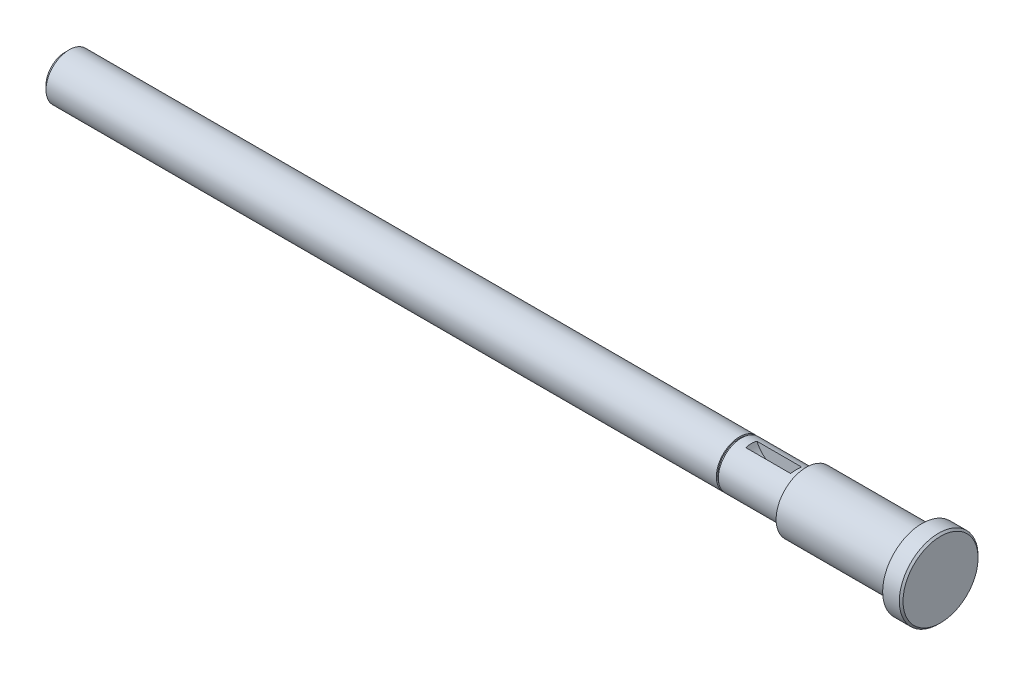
ISO-10303-21;
HEADER;
FILE_DESCRIPTION(('STEP AP214'),'2;1');
FILE_NAME('part.step','',(''),(''),'','','');
FILE_SCHEMA(('AUTOMOTIVE_DESIGN { 1 0 10303 214 1 1 1 1 }'));
ENDSEC;
DATA;
#1=APPLICATION_CONTEXT('core data for automotive mechanical design processes');
#2=APPLICATION_PROTOCOL_DEFINITION('international standard','automotive_design',2000,#1);
#3=PRODUCT_CONTEXT('',#1,'mechanical');
#4=PRODUCT('Part','Part','',(#3));
#5=PRODUCT_RELATED_PRODUCT_CATEGORY('part','',(#4));
#6=PRODUCT_DEFINITION_FORMATION('','',#4);
#7=PRODUCT_DEFINITION_CONTEXT('part definition',#1,'design');
#8=PRODUCT_DEFINITION('design','',#6,#7);
#9=PRODUCT_DEFINITION_SHAPE('','',#8);
#10=(LENGTH_UNIT() NAMED_UNIT(*) SI_UNIT(.MILLI.,.METRE.));
#11=(NAMED_UNIT(*) PLANE_ANGLE_UNIT() SI_UNIT($,.RADIAN.));
#12=(NAMED_UNIT(*) SI_UNIT($,.STERADIAN.) SOLID_ANGLE_UNIT());
#13=UNCERTAINTY_MEASURE_WITH_UNIT(LENGTH_MEASURE(1.E-05),#10,'distance_accuracy_value','');
#14=(GEOMETRIC_REPRESENTATION_CONTEXT(3) GLOBAL_UNCERTAINTY_ASSIGNED_CONTEXT((#13)) GLOBAL_UNIT_ASSIGNED_CONTEXT((#10,
#11,#12)) REPRESENTATION_CONTEXT('',''));
#15=CARTESIAN_POINT('',(0.,0.,0.));
#16=DIRECTION('',(0.,0.,1.));
#17=DIRECTION('',(1.,0.,0.));
#18=AXIS2_PLACEMENT_3D('',#15,#16,#17);
#19=CARTESIAN_POINT('',(-640.640735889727,0.,0.));
#20=DIRECTION('',(-1.,0.,0.));
#21=DIRECTION('',(0.,0.,1.));
#22=AXIS2_PLACEMENT_3D('',#19,#20,#21);
#23=CYLINDRICAL_SURFACE('',#22,25.);
#24=CARTESIAN_POINT('',(0.,0.,0.));
#25=DIRECTION('',(-1.,0.,0.));
#26=DIRECTION('',(0.,0.,1.));
#27=AXIS2_PLACEMENT_3D('',#24,#25,#26);
#28=CIRCLE('',#27,25.);
#29=CARTESIAN_POINT('',(0.,0.,25.));
#30=VERTEX_POINT('',#29);
#31=EDGE_CURVE('E133',#30,#30,#28,.T.);
#32=ORIENTED_EDGE('',*,*,#31,.T.);
#33=EDGE_LOOP('',(#32));
#34=FACE_BOUND('',#33,.T.);
#35=CARTESIAN_POINT('',(-69.85,0.,0.));
#36=DIRECTION('',(-1.,0.,0.));
#37=DIRECTION('',(0.,0.,1.));
#38=AXIS2_PLACEMENT_3D('',#35,#36,#37);
#39=CIRCLE('',#38,25.);
#40=CARTESIAN_POINT('',(-69.85,0.,25.));
#41=VERTEX_POINT('',#40);
#42=EDGE_CURVE('E136',#41,#41,#39,.T.);
#43=ORIENTED_EDGE('',*,*,#42,.F.);
#44=EDGE_LOOP('',(#43));
#45=FACE_BOUND('',#44,.T.);
#46=DIRECTION('',(-1.,0.,0.));
#47=VECTOR('',#46,1.);
#48=CARTESIAN_POINT('',(-640.640735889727,24.2693221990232,-6.));
#49=LINE('',#48,#47);
#50=CARTESIAN_POINT('',(-10.8895477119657,24.2693221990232,-6.));
#51=VERTEX_POINT('',#50);
#52=CARTESIAN_POINT('',(-59.1104522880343,24.2693221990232,-6.));
#53=VERTEX_POINT('',#52);
#54=EDGE_CURVE('E11',#51,#53,#49,.T.);
#55=ORIENTED_EDGE('',*,*,#54,.F.);
#56=CARTESIAN_POINT('',(-10.8895477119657,24.2693221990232,-6.));
#57=CARTESIAN_POINT('',(-10.857652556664,24.3483818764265,-5.68023988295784));
#58=CARTESIAN_POINT('',(-10.8287137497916,24.421176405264,-5.35864311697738));
#59=CARTESIAN_POINT('',(-10.7764663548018,24.5540658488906,-4.71238692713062));
#60=CARTESIAN_POINT('',(-10.7531576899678,24.6141609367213,-4.38772754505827));
#61=CARTESIAN_POINT('',(-10.7118823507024,24.7214970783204,-3.73587068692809));
#62=CARTESIAN_POINT('',(-10.6939169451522,24.7687350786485,-3.40867262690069));
#63=CARTESIAN_POINT('',(-10.6631271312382,24.8502192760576,-2.75244486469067));
#64=CARTESIAN_POINT('',(-10.6503026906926,24.8844655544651,-2.42341517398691));
#65=CARTESIAN_POINT('',(-10.6197292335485,24.9663941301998,-1.44851531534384));
#66=CARTESIAN_POINT('',(-10.6090122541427,24.9955713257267,-0.800764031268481));
#67=CARTESIAN_POINT('',(-10.6060894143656,25.0034927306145,0.494833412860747));
#68=CARTESIAN_POINT('',(-10.6138764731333,24.9822562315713,1.14267944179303));
#69=CARTESIAN_POINT('',(-10.6405342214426,24.9106103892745,2.14175998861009));
#70=CARTESIAN_POINT('',(-10.6527926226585,24.8777567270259,2.49452079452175));
#71=CARTESIAN_POINT('',(-10.6831505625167,24.7971355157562,3.19802526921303));
#72=CARTESIAN_POINT('',(-10.7012488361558,24.7493711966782,3.54876935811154));
#73=CARTESIAN_POINT('',(-10.7437805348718,24.6384062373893,4.25170865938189));
#74=CARTESIAN_POINT('',(-10.7682867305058,24.5750288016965,4.60387153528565));
#75=CARTESIAN_POINT('',(-10.8238872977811,24.433331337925,5.30474272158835));
#76=CARTESIAN_POINT('',(-10.8549832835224,24.355007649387,5.65345016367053));
#77=CARTESIAN_POINT('',(-10.8895477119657,24.2693221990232,6.));
#78=B_SPLINE_CURVE_WITH_KNOTS('',3,(#56,#57,#58,#59,#60,#61,#62,#63,#64,#65,#66,#67,#68,#69,#70,
#71,#72,#73,#74,#75,#76,#77),.UNSPECIFIED.,.F.,.F.,(4,2,2,2,2,2,2,2,2,2,4),(0.,
0.992699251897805,1.98538497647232,2.97830624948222,3.97122130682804,5.91433610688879,
7.85670746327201,8.91988835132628,9.982839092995,11.0584290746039,12.1342828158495),.UNSPECIFIED.);
#79=CARTESIAN_POINT('',(-10.8895477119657,24.2693221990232,6.));
#80=VERTEX_POINT('',#79);
#81=EDGE_CURVE('E41',#51,#80,#78,.T.);
#82=ORIENTED_EDGE('',*,*,#81,.T.);
#83=DIRECTION('',(-1.,0.,0.));
#84=VECTOR('',#83,1.);
#85=CARTESIAN_POINT('',(-640.640735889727,24.2693221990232,6.));
#86=LINE('',#85,#84);
#87=CARTESIAN_POINT('',(-59.1104522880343,24.2693221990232,6.));
#88=VERTEX_POINT('',#87);
#89=EDGE_CURVE('E59',#80,#88,#86,.T.);
#90=ORIENTED_EDGE('',*,*,#89,.T.);
#91=CARTESIAN_POINT('',(-59.1104522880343,24.2693221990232,6.));
#92=CARTESIAN_POINT('',(-59.142347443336,24.3483818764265,5.68023988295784));
#93=CARTESIAN_POINT('',(-59.1712862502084,24.421176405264,5.35864311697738));
#94=CARTESIAN_POINT('',(-59.2235336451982,24.5540658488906,4.71238692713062));
#95=CARTESIAN_POINT('',(-59.2468423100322,24.6141609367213,4.38772754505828));
#96=CARTESIAN_POINT('',(-59.2881176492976,24.7214970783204,3.73587068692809));
#97=CARTESIAN_POINT('',(-59.3060830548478,24.7687350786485,3.40867262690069));
#98=CARTESIAN_POINT('',(-59.3368728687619,24.8502192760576,2.75244486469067));
#99=CARTESIAN_POINT('',(-59.3496973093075,24.8844655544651,2.42341517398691));
#100=CARTESIAN_POINT('',(-59.3802707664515,24.9663941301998,1.44851531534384));
#101=CARTESIAN_POINT('',(-59.3909877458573,24.9955713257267,0.800764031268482));
#102=CARTESIAN_POINT('',(-59.3939105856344,25.0034927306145,-0.494833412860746));
#103=CARTESIAN_POINT('',(-59.3861235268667,24.9822562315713,-1.14267944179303));
#104=CARTESIAN_POINT('',(-59.3594657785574,24.9106103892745,-2.14175998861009));
#105=CARTESIAN_POINT('',(-59.3472073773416,24.8777567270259,-2.49452079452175));
#106=CARTESIAN_POINT('',(-59.3168494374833,24.7971355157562,-3.19802526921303));
#107=CARTESIAN_POINT('',(-59.2987511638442,24.7493711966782,-3.54876935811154));
#108=CARTESIAN_POINT('',(-59.2562194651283,24.6384062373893,-4.2517086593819));
#109=CARTESIAN_POINT('',(-59.2317132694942,24.5750288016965,-4.60387153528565));
#110=CARTESIAN_POINT('',(-59.1761127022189,24.433331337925,-5.30474272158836));
#111=CARTESIAN_POINT('',(-59.1450167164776,24.355007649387,-5.65345016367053));
#112=CARTESIAN_POINT('',(-59.1104522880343,24.2693221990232,-6.));
#113=B_SPLINE_CURVE_WITH_KNOTS('',3,(#91,#92,#93,#94,#95,#96,#97,#98,#99,#100,#101,#102,#103,
#104,#105,#106,#107,#108,#109,#110,#111,#112),.UNSPECIFIED.,.F.,.F.,(4,2,2,2,2,2,2,2,2,2,4),(0.,
0.992699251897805,1.98538497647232,2.97830624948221,3.97122130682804,5.91433610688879,
7.85670746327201,8.91988835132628,9.98283909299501,11.0584290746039,12.1342828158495),.UNSPECIFIED.);
#114=EDGE_CURVE('E63',#88,#53,#113,.T.);
#115=ORIENTED_EDGE('',*,*,#114,.T.);
#116=EDGE_LOOP('',(#55,#82,#90,#115));
#117=FACE_BOUND('',#116,.T.);
#118=ADVANCED_FACE('F33',(#34,#45,#117),#23,.T.);
#119=CARTESIAN_POINT('',(145.,42.5,0.));
#120=DIRECTION('',(-1.,0.,0.));
#121=DIRECTION('',(0.,0.,1.));
#122=AXIS2_PLACEMENT_3D('',#119,#120,#121);
#123=PLANE('',#122);
#124=CARTESIAN_POINT('',(145.,0.,0.));
#125=DIRECTION('',(-1.,0.,0.));
#126=DIRECTION('',(0.,0.,1.));
#127=AXIS2_PLACEMENT_3D('',#124,#125,#126);
#128=CIRCLE('',#127,40.5);
#129=CARTESIAN_POINT('',(145.,0.,40.5));
#130=VERTEX_POINT('',#129);
#131=EDGE_CURVE('E157',#130,#130,#128,.F.);
#132=ORIENTED_EDGE('',*,*,#131,.T.);
#133=EDGE_LOOP('',(#132));
#134=FACE_BOUND('',#133,.T.);
#135=ADVANCED_FACE('F35',(#134),#123,.F.);
#136=CARTESIAN_POINT('',(-640.640735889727,0.,0.));
#137=DIRECTION('',(-1.,0.,0.));
#138=DIRECTION('',(0.,0.,1.));
#139=AXIS2_PLACEMENT_3D('',#136,#137,#138);
#140=CYLINDRICAL_SURFACE('',#139,42.5);
#141=CARTESIAN_POINT('',(143.,0.,0.));
#142=DIRECTION('',(-1.,0.,0.));
#143=DIRECTION('',(0.,0.,1.));
#144=AXIS2_PLACEMENT_3D('',#141,#142,#143);
#145=CIRCLE('',#144,42.5);
#146=CARTESIAN_POINT('',(143.,0.,42.5));
#147=VERTEX_POINT('',#146);
#148=EDGE_CURVE('E154',#147,#147,#145,.T.);
#149=ORIENTED_EDGE('',*,*,#148,.T.);
#150=EDGE_LOOP('',(#149));
#151=FACE_BOUND('',#150,.T.);
#152=CARTESIAN_POINT('',(125.,0.,0.));
#153=DIRECTION('',(-1.,0.,0.));
#154=DIRECTION('',(0.,0.,1.));
#155=AXIS2_PLACEMENT_3D('',#152,#153,#154);
#156=CIRCLE('',#155,42.5);
#157=CARTESIAN_POINT('',(125.,0.,42.5));
#158=VERTEX_POINT('',#157);
#159=EDGE_CURVE('E151',#158,#158,#156,.T.);
#160=ORIENTED_EDGE('',*,*,#159,.F.);
#161=EDGE_LOOP('',(#160));
#162=FACE_BOUND('',#161,.T.);
#163=ADVANCED_FACE('F128',(#151,#162),#140,.T.);
#164=CARTESIAN_POINT('',(125.,32.5,0.));
#165=DIRECTION('',(1.,0.,0.));
#166=DIRECTION('',(0.,0.,-1.));
#167=AXIS2_PLACEMENT_3D('',#164,#165,#166);
#168=PLANE('',#167);
#169=CARTESIAN_POINT('',(125.,0.,0.));
#170=DIRECTION('',(-1.,0.,0.));
#171=DIRECTION('',(0.,0.,1.));
#172=AXIS2_PLACEMENT_3D('',#169,#170,#171);
#173=CIRCLE('',#172,32.5);
#174=CARTESIAN_POINT('',(125.,0.,32.5));
#175=VERTEX_POINT('',#174);
#176=EDGE_CURVE('E148',#175,#175,#173,.T.);
#177=ORIENTED_EDGE('',*,*,#176,.F.);
#178=EDGE_LOOP('',(#177));
#179=FACE_BOUND('',#178,.T.);
#180=ORIENTED_EDGE('',*,*,#159,.T.);
#181=EDGE_LOOP('',(#180));
#182=FACE_BOUND('',#181,.T.);
#183=ADVANCED_FACE('F248',(#179,#182),#168,.F.);
#184=CARTESIAN_POINT('',(-640.640735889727,0.,0.));
#185=DIRECTION('',(-1.,0.,0.));
#186=DIRECTION('',(0.,0.,1.));
#187=AXIS2_PLACEMENT_3D('',#184,#185,#186);
#188=CYLINDRICAL_SURFACE('',#187,32.5);
#189=CARTESIAN_POINT('',(0.,0.,0.));
#190=DIRECTION('',(-1.,0.,0.));
#191=DIRECTION('',(0.,0.,1.));
#192=AXIS2_PLACEMENT_3D('',#189,#190,#191);
#193=CIRCLE('',#192,32.5);
#194=CARTESIAN_POINT('',(0.,0.,32.5));
#195=VERTEX_POINT('',#194);
#196=EDGE_CURVE('E139',#195,#195,#193,.T.);
#197=ORIENTED_EDGE('',*,*,#196,.F.);
#198=EDGE_LOOP('',(#197));
#199=FACE_BOUND('',#198,.T.);
#200=ORIENTED_EDGE('',*,*,#176,.T.);
#201=EDGE_LOOP('',(#200));
#202=FACE_BOUND('',#201,.T.);
#203=ADVANCED_FACE('F119',(#199,#202),#188,.T.);
#204=CARTESIAN_POINT('',(0.,25.,0.));
#205=DIRECTION('',(1.,0.,0.));
#206=DIRECTION('',(0.,0.,-1.));
#207=AXIS2_PLACEMENT_3D('',#204,#205,#206);
#208=PLANE('',#207);
#209=ORIENTED_EDGE('',*,*,#31,.F.);
#210=EDGE_LOOP('',(#209));
#211=FACE_BOUND('',#210,.T.);
#212=ORIENTED_EDGE('',*,*,#196,.T.);
#213=EDGE_LOOP('',(#212));
#214=FACE_BOUND('',#213,.T.);
#215=ADVANCED_FACE('F114',(#211,#214),#208,.F.);
#216=CARTESIAN_POINT('',(-69.85,23.5,0.));
#217=DIRECTION('',(1.,0.,0.));
#218=DIRECTION('',(0.,0.,-1.));
#219=AXIS2_PLACEMENT_3D('',#216,#217,#218);
#220=PLANE('',#219);
#221=CARTESIAN_POINT('',(-69.85,0.,0.));
#222=DIRECTION('',(-1.,0.,0.));
#223=DIRECTION('',(0.,0.,1.));
#224=AXIS2_PLACEMENT_3D('',#221,#222,#223);
#225=CIRCLE('',#224,23.5);
#226=CARTESIAN_POINT('',(-69.85,0.,23.5));
#227=VERTEX_POINT('',#226);
#228=EDGE_CURVE('E137',#227,#227,#225,.T.);
#229=ORIENTED_EDGE('',*,*,#228,.F.);
#230=EDGE_LOOP('',(#229));
#231=FACE_BOUND('',#230,.T.);
#232=ORIENTED_EDGE('',*,*,#42,.T.);
#233=EDGE_LOOP('',(#232));
#234=FACE_BOUND('',#233,.T.);
#235=ADVANCED_FACE('F111',(#231,#234),#220,.F.);
#236=CARTESIAN_POINT('',(-640.640735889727,0.,0.));
#237=DIRECTION('',(-1.,0.,0.));
#238=DIRECTION('',(0.,0.,1.));
#239=AXIS2_PLACEMENT_3D('',#236,#237,#238);
#240=CYLINDRICAL_SURFACE('',#239,23.5);
#241=CARTESIAN_POINT('',(-72.,0.,0.));
#242=DIRECTION('',(-1.,0.,0.));
#243=DIRECTION('',(0.,0.,1.));
#244=AXIS2_PLACEMENT_3D('',#241,#242,#243);
#245=CIRCLE('',#244,23.5);
#246=CARTESIAN_POINT('',(-72.,0.,23.5));
#247=VERTEX_POINT('',#246);
#248=EDGE_CURVE('E142',#247,#247,#245,.T.);
#249=ORIENTED_EDGE('',*,*,#248,.F.);
#250=EDGE_LOOP('',(#249));
#251=FACE_BOUND('',#250,.T.);
#252=ORIENTED_EDGE('',*,*,#228,.T.);
#253=EDGE_LOOP('',(#252));
#254=FACE_BOUND('',#253,.T.);
#255=ADVANCED_FACE('F108',(#251,#254),#240,.T.);
#256=CARTESIAN_POINT('',(-72.,25.,0.));
#257=DIRECTION('',(-1.,0.,0.));
#258=DIRECTION('',(0.,0.,1.));
#259=AXIS2_PLACEMENT_3D('',#256,#257,#258);
#260=PLANE('',#259);
#261=CARTESIAN_POINT('',(-72.,0.,0.));
#262=DIRECTION('',(-1.,0.,0.));
#263=DIRECTION('',(0.,0.,1.));
#264=AXIS2_PLACEMENT_3D('',#261,#262,#263);
#265=CIRCLE('',#264,25.);
#266=CARTESIAN_POINT('',(-72.,0.,25.));
#267=VERTEX_POINT('',#266);
#268=EDGE_CURVE('E170',#267,#267,#265,.T.);
#269=ORIENTED_EDGE('',*,*,#268,.F.);
#270=EDGE_LOOP('',(#269));
#271=FACE_BOUND('',#270,.T.);
#272=ORIENTED_EDGE('',*,*,#248,.T.);
#273=EDGE_LOOP('',(#272));
#274=FACE_BOUND('',#273,.T.);
#275=ADVANCED_FACE('F104',(#271,#274),#260,.F.);
#276=CARTESIAN_POINT('',(-640.640735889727,0.,0.));
#277=DIRECTION('',(-1.,0.,0.));
#278=DIRECTION('',(0.,0.,1.));
#279=AXIS2_PLACEMENT_3D('',#276,#277,#278);
#280=CYLINDRICAL_SURFACE('',#279,24.9999999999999);
#281=CARTESIAN_POINT('',(-795.5,0.,0.));
#282=DIRECTION('',(1.,0.,0.));
#283=DIRECTION('',(0.,0.,-1.));
#284=AXIS2_PLACEMENT_3D('',#281,#282,#283);
#285=CIRCLE('',#284,24.9999999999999);
#286=CARTESIAN_POINT('',(-795.5,0.,-24.9999999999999));
#287=VERTEX_POINT('',#286);
#288=EDGE_CURVE('E64',#287,#287,#285,.T.);
#289=ORIENTED_EDGE('',*,*,#288,.T.);
#290=EDGE_LOOP('',(#289));
#291=FACE_BOUND('',#290,.T.);
#292=ORIENTED_EDGE('',*,*,#268,.T.);
#293=EDGE_LOOP('',(#292));
#294=FACE_BOUND('',#293,.T.);
#295=ADVANCED_FACE('F100',(#291,#294),#280,.T.);
#296=CARTESIAN_POINT('',(-800.,24.9999999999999,0.));
#297=DIRECTION('',(1.,0.,0.));
#298=DIRECTION('',(0.,0.,-1.));
#299=AXIS2_PLACEMENT_3D('',#296,#297,#298);
#300=PLANE('',#299);
#301=CARTESIAN_POINT('',(-800.,0.,0.));
#302=DIRECTION('',(1.,0.,0.));
#303=DIRECTION('',(0.,0.,-1.));
#304=AXIS2_PLACEMENT_3D('',#301,#302,#303);
#305=CIRCLE('',#304,20.4999999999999);
#306=CARTESIAN_POINT('',(-800.,0.,-20.4999999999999));
#307=VERTEX_POINT('',#306);
#308=EDGE_CURVE('E160',#307,#307,#305,.F.);
#309=ORIENTED_EDGE('',*,*,#308,.T.);
#310=EDGE_LOOP('',(#309));
#311=FACE_BOUND('',#310,.T.);
#312=ADVANCED_FACE('F96',(#311),#300,.F.);
#313=CARTESIAN_POINT('',(143.,0.,0.));
#314=DIRECTION('',(-1.,0.,0.));
#315=DIRECTION('',(0.,0.,1.));
#316=AXIS2_PLACEMENT_3D('',#313,#314,#315);
#317=CONICAL_SURFACE('',#316,42.5,0.785398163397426);
#318=ORIENTED_EDGE('',*,*,#131,.F.);
#319=EDGE_LOOP('',(#318));
#320=FACE_BOUND('',#319,.T.);
#321=ORIENTED_EDGE('',*,*,#148,.F.);
#322=EDGE_LOOP('',(#321));
#323=FACE_BOUND('',#322,.T.);
#324=ADVANCED_FACE('F92',(#320,#323),#317,.T.);
#325=CARTESIAN_POINT('',(-800.,0.,0.));
#326=DIRECTION('',(1.,0.,0.));
#327=DIRECTION('',(0.,0.,-1.));
#328=AXIS2_PLACEMENT_3D('',#325,#326,#327);
#329=CONICAL_SURFACE('',#328,20.4999999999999,0.785398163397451);
#330=ORIENTED_EDGE('',*,*,#288,.F.);
#331=EDGE_LOOP('',(#330));
#332=FACE_BOUND('',#331,.T.);
#333=ORIENTED_EDGE('',*,*,#308,.F.);
#334=EDGE_LOOP('',(#333));
#335=FACE_BOUND('',#334,.T.);
#336=ADVANCED_FACE('F87',(#332,#335),#329,.T.);
#337=CARTESIAN_POINT('',(-35.,34.,-6.));
#338=DIRECTION('',(0.,0.,1.));
#339=DIRECTION('',(1.,0.,0.));
#340=AXIS2_PLACEMENT_3D('',#337,#338,#339);
#341=CYLINDRICAL_SURFACE('',#340,26.);
#342=CARTESIAN_POINT('',(-35.,34.,-6.));
#343=DIRECTION('',(0.,0.,1.));
#344=DIRECTION('',(1.,0.,0.));
#345=AXIS2_PLACEMENT_3D('',#342,#343,#344);
#346=CIRCLE('',#345,26.);
#347=EDGE_CURVE('E67',#53,#51,#346,.T.);
#348=ORIENTED_EDGE('',*,*,#347,.F.);
#349=ORIENTED_EDGE('',*,*,#114,.F.);
#350=CARTESIAN_POINT('',(-35.,34.,6.));
#351=DIRECTION('',(0.,0.,1.));
#352=DIRECTION('',(1.,0.,0.));
#353=AXIS2_PLACEMENT_3D('',#350,#351,#352);
#354=CIRCLE('',#353,26.);
#355=EDGE_CURVE('E47',#88,#80,#354,.T.);
#356=ORIENTED_EDGE('',*,*,#355,.T.);
#357=ORIENTED_EDGE('',*,*,#81,.F.);
#358=EDGE_LOOP('',(#348,#349,#356,#357));
#359=FACE_BOUND('',#358,.T.);
#360=ADVANCED_FACE('F66',(#359),#341,.F.);
#361=CARTESIAN_POINT('',(-35.,34.,-6.));
#362=DIRECTION('',(0.,0.,1.));
#363=DIRECTION('',(1.,0.,0.));
#364=AXIS2_PLACEMENT_3D('',#361,#362,#363);
#365=PLANE('',#364);
#366=ORIENTED_EDGE('',*,*,#54,.T.);
#367=ORIENTED_EDGE('',*,*,#347,.T.);
#368=EDGE_LOOP('',(#366,#367));
#369=FACE_BOUND('',#368,.T.);
#370=ADVANCED_FACE('F86',(#369),#365,.T.);
#371=CARTESIAN_POINT('',(-35.,34.,6.));
#372=DIRECTION('',(0.,0.,1.));
#373=DIRECTION('',(1.,0.,0.));
#374=AXIS2_PLACEMENT_3D('',#371,#372,#373);
#375=PLANE('',#374);
#376=ORIENTED_EDGE('',*,*,#355,.F.);
#377=ORIENTED_EDGE('',*,*,#89,.F.);
#378=EDGE_LOOP('',(#376,#377));
#379=FACE_BOUND('',#378,.T.);
#380=ADVANCED_FACE('F60',(#379),#375,.F.);
#381=CLOSED_SHELL('',(#118,#135,#163,#183,#203,#215,#235,#255,#275,#295,#312,#324,#336,#360,
#370,#380));
#382=MANIFOLD_SOLID_BREP('B2',#381);
#383=ADVANCED_BREP_SHAPE_REPRESENTATION('',(#18,#382),#14);
#384=SHAPE_DEFINITION_REPRESENTATION(#9,#383);
ENDSEC;
END-ISO-10303-21;
